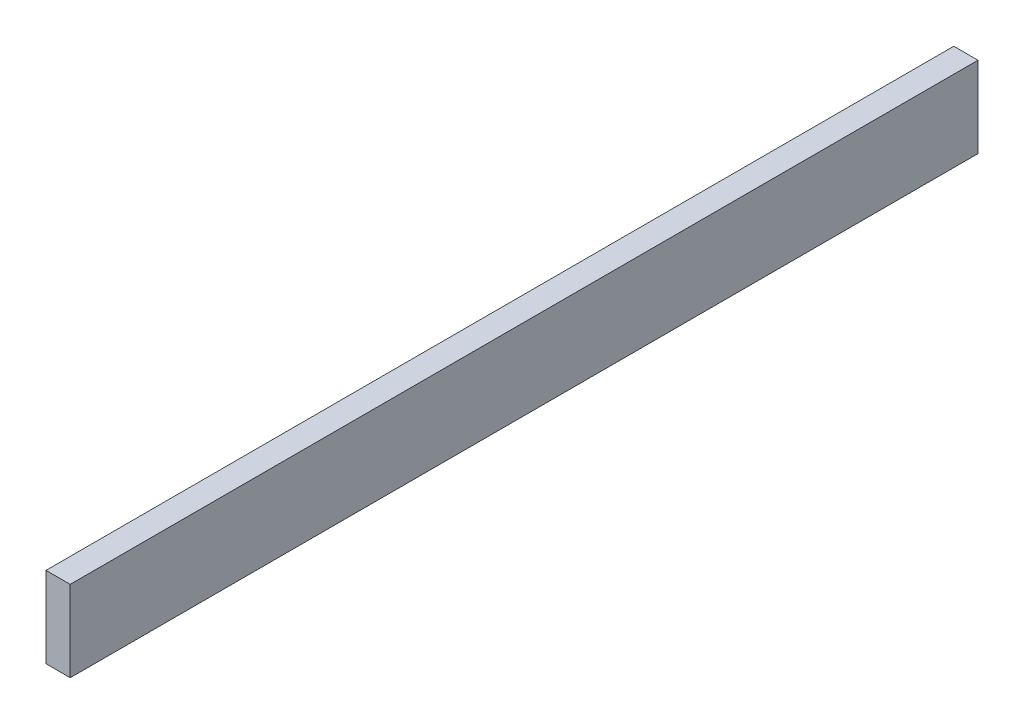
from build123d import *

# Parameters (mm, degrees)
SKETCH1_W           = 450
SKETCH1_H           = 40.1
BOSS_EXTRUDE1_DEPTH = 12


with BuildPart() as part:
    # Sketch1 → Boss-Extrude1 (new body)
    with BuildSketch(Plane(origin=(0, 0, 0), x_dir=(0, 0, -1), z_dir=(1, 0, 0))):
        with Locations((7.647584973, 44.753220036)):
            Rectangle(SKETCH1_W, SKETCH1_H)
    extrude(amount=BOSS_EXTRUDE1_DEPTH)


solid = part.part
